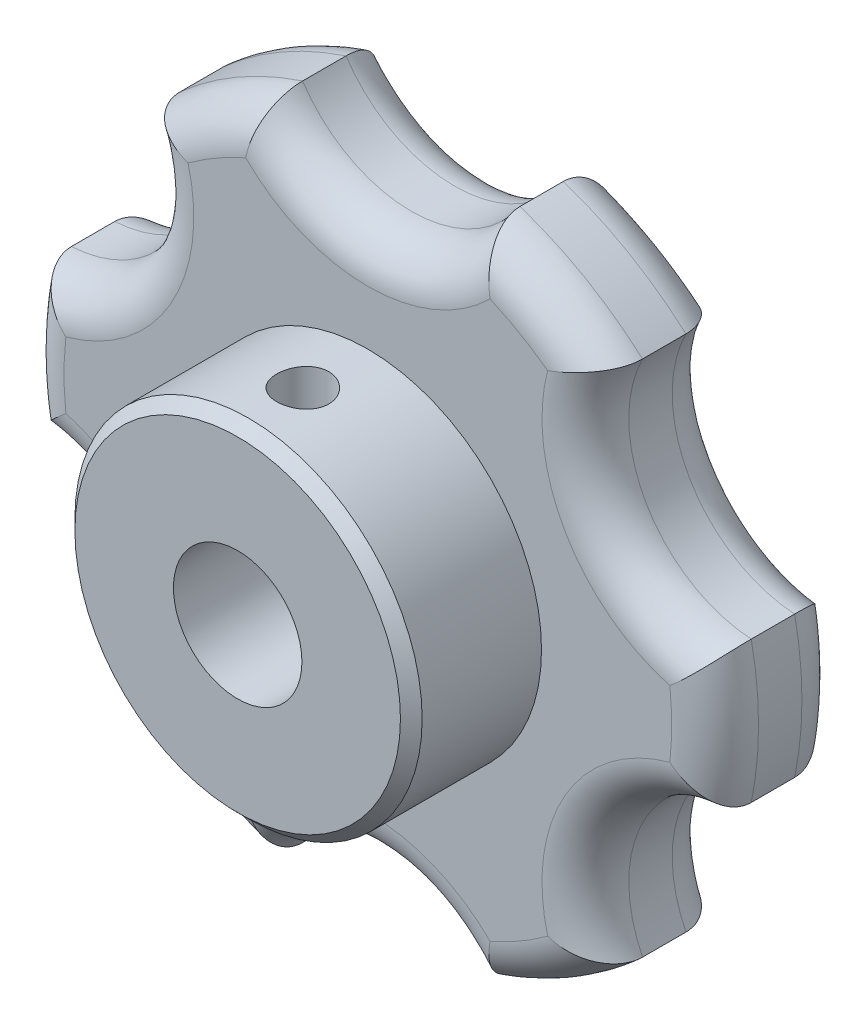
from build123d import *

# Parameters (mm, degrees)
SKETCH1_R               = 25.4
BASE_EXTRUDE_DEPTH      = 9.525
SKETCH2_R               = 9.525
CUT_EXTRUDE1_DEPTH      = 38.162422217
CIRPATTERN1_COUNT       = 6
FILLET1_R               = 3.175
FILLET2_R               = 3.175
SKETCH3_R               = 12.7
BOSS_EXTRUDE1_DEPTH     = 9.525
CHAMFER1_SIZE           = 0.79375
CUT_EXTRUDE2_REACH      = 50.621
CUT_EXTRUDE2_END_RADIUS = 4.699
SKETCH5_R               = 1.905


with BuildPart() as part:
    # Sketch1 → Base-Extrude (new body)
    with BuildSketch(Plane.XY):
        with Locations(Location((0, 0, 0), (0, 0, 180))):
            Circle(SKETCH1_R)
    extrude(amount=BASE_EXTRUDE_DEPTH)

    # Sketch2 → Cut-Extrude1 (cut, through all)
    with BuildSketch(Plane.XY):
        with Locations((0, 29.36875)):
            Circle(SKETCH2_R)
    cut_extrude1 = extrude(amount=CUT_EXTRUDE1_DEPTH, mode=Mode.SUBTRACT)

    # CirPattern1: Cut-Extrude1 ×6 about axis
    cirpattern1_axis = Axis((0, 0, 0), (0, 0, 1))
    for i in range(1, CIRPATTERN1_COUNT):
        add(cut_extrude1.rotate(cirpattern1_axis, i * 360 / CIRPATTERN1_COUNT), mode=Mode.SUBTRACT)

    # Fillet1
    fillet1_edges = [part.edges().sort_by_distance(p)[0] for p in [
        (12.7, 21.997045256, 9.525),
        (17.185191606, 9.921875, 9.525),
        (25.4, 0, 9.525),
        (17.185191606, -9.921875, 9.525),
        (12.7, -21.997045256, 9.525),
        (0, -19.84375, 9.525),
        (-12.7, -21.997045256, 9.525),
        (-17.185191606, -9.921875, 9.525),
        (-25.4, 0, 9.525),
        (-17.185191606, 9.921875, 9.525),
        (-12.7, 21.997045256, 9.525),
        (0, 19.84375, 9.525),
    ]]
    fillet(fillet1_edges, radius=FILLET1_R)

    # Fillet2
    fillet2_edges = [part.edges().sort_by_distance(p)[0] for p in [
        (12.7, 21.997045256, 0),
        (17.185191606, 9.921875, 0),
        (25.4, 0, 0),
        (17.185191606, -9.921875, 0),
        (12.7, -21.997045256, 0),
        (0, -19.84375, 0),
        (-12.7, -21.997045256, 0),
        (-17.185191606, -9.921875, 0),
        (-25.4, 0, 0),
        (-12.7, 21.997045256, 0),
        (-17.185191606, 9.921875, 0),
        (0, 19.84375, 0),
    ]]
    fillet(fillet2_edges, radius=FILLET2_R)

    # Sketch3 → Boss-Extrude1 (add)
    with BuildSketch(Plane.XY.offset(9.525)):
        with Locations(Location((0, 0, 0), (0, 0, 180))):
            Circle(SKETCH3_R)
    extrude(amount=BOSS_EXTRUDE1_DEPTH)

    # Chamfer1
    chamfer1_edges = [part.edges().sort_by_distance(p)[0] for p in [
        (12.7, 0, 19.05),
    ]]
    chamfer(chamfer1_edges, length=CHAMFER1_SIZE)

    # Sketch4 → Cut-Revolve1 (revolve, cut)
    with BuildSketch(Plane(origin=(0, 0, 0), x_dir=(1, 0, 0), z_dir=(0, 1, 0))):
        Polygon((0, -19.05), (0, -1.5875), (4.699, -4.410944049), (4.699, -19.05), align=None)
    revolve(axis=Axis((0, 0, 24.511263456), (0, 0, -1)), mode=Mode.SUBTRACT)

    # Cut-Extrude2: up to this cylinder (the profile starts outside it)
    cut_extrude2_end = Plane(origin=(0, 0, 14.2875), z_dir=(0, 0, 1)) * Cylinder(CUT_EXTRUDE2_END_RADIUS, 111.64, mode=Mode.PRIVATE)
    # Sketch5 → Cut-Extrude2 (cut, up to the surface)
    with BuildSketch(Plane(origin=(0, 12.7, 0), x_dir=(-1, 0, 0), z_dir=(0, 1, 0)), mode=Mode.PRIVATE) as cut_extrude2_sk1:
        with Locations(Location((0, 14.2875, 0), (0, 0, 90))):
            Circle(SKETCH5_R)
    cut_extrude2_tool1 = extrude(cut_extrude2_sk1.sketch, amount=-CUT_EXTRUDE2_REACH, mode=Mode.PRIVATE) - cut_extrude2_end
    add(cut_extrude2_tool1.solids().sort_by_distance((0, 12.7, 14.2875))[0], mode=Mode.SUBTRACT)


solid = part.part
